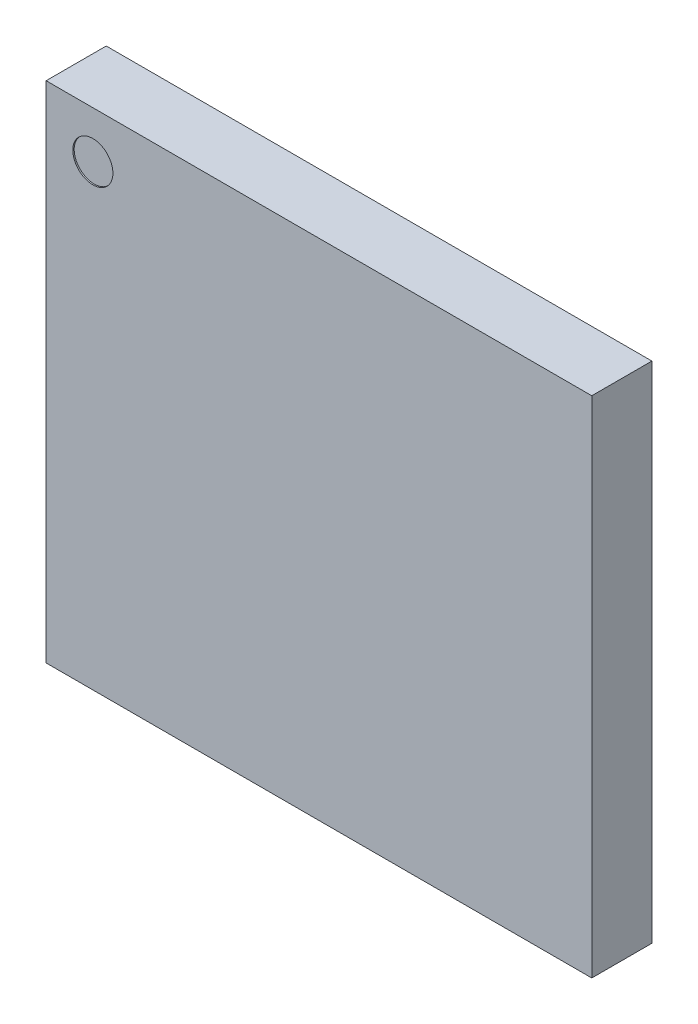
ISO-10303-21;
HEADER;
FILE_DESCRIPTION(('STEP AP214'),'2;1');
FILE_NAME('part.step','',(''),(''),'','','');
FILE_SCHEMA(('AUTOMOTIVE_DESIGN { 1 0 10303 214 1 1 1 1 }'));
ENDSEC;
DATA;
#1=APPLICATION_CONTEXT('core data for automotive mechanical design processes');
#2=APPLICATION_PROTOCOL_DEFINITION('international standard','automotive_design',2000,#1);
#3=PRODUCT_CONTEXT('',#1,'mechanical');
#4=PRODUCT('Part','Part','',(#3));
#5=PRODUCT_RELATED_PRODUCT_CATEGORY('part','',(#4));
#6=PRODUCT_DEFINITION_FORMATION('','',#4);
#7=PRODUCT_DEFINITION_CONTEXT('part definition',#1,'design');
#8=PRODUCT_DEFINITION('design','',#6,#7);
#9=PRODUCT_DEFINITION_SHAPE('','',#8);
#10=(LENGTH_UNIT() NAMED_UNIT(*) SI_UNIT(.MILLI.,.METRE.));
#11=(NAMED_UNIT(*) PLANE_ANGLE_UNIT() SI_UNIT($,.RADIAN.));
#12=(NAMED_UNIT(*) SI_UNIT($,.STERADIAN.) SOLID_ANGLE_UNIT());
#13=UNCERTAINTY_MEASURE_WITH_UNIT(LENGTH_MEASURE(1.E-05),#10,'distance_accuracy_value','');
#14=(GEOMETRIC_REPRESENTATION_CONTEXT(3) GLOBAL_UNCERTAINTY_ASSIGNED_CONTEXT((#13)) GLOBAL_UNIT_ASSIGNED_CONTEXT((#10,
#11,#12)) REPRESENTATION_CONTEXT('',''));
#15=CARTESIAN_POINT('',(0.,0.,0.));
#16=DIRECTION('',(0.,0.,1.));
#17=DIRECTION('',(1.,0.,0.));
#18=AXIS2_PLACEMENT_3D('',#15,#16,#17);
#19=CARTESIAN_POINT('',(0.,-1.88750000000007,0.582499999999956));
#20=DIRECTION('',(0.,0.,1.));
#21=DIRECTION('',(1.,0.,0.));
#22=AXIS2_PLACEMENT_3D('',#19,#20,#21);
#23=PLANE('',#22);
#24=CARTESIAN_POINT('',(-1.69250000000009,1.53749999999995,0.582499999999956));
#25=DIRECTION('',(0.,0.,1.));
#26=DIRECTION('',(1.,0.,0.));
#27=AXIS2_PLACEMENT_3D('',#24,#25,#26);
#28=CIRCLE('',#27,0.15000000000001);
#29=CARTESIAN_POINT('',(-1.54250000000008,1.53749999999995,0.582499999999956));
#30=VERTEX_POINT('',#29);
#31=EDGE_CURVE('E19',#30,#30,#28,.T.);
#32=ORIENTED_EDGE('',*,*,#31,.T.);
#33=EDGE_LOOP('',(#32));
#34=FACE_BOUND('',#33,.T.);
#35=ADVANCED_FACE('F16',(#34),#23,.T.);
#36=CARTESIAN_POINT('',(-1.69250000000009,1.53749999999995,0.592499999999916));
#37=DIRECTION('',(0.,0.,1.));
#38=DIRECTION('',(1.,0.,0.));
#39=AXIS2_PLACEMENT_3D('',#36,#37,#38);
#40=CYLINDRICAL_SURFACE('',#39,0.15000000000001);
#41=ORIENTED_EDGE('',*,*,#31,.F.);
#42=EDGE_LOOP('',(#41));
#43=FACE_BOUND('',#42,.T.);
#44=CARTESIAN_POINT('',(-1.69250000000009,1.53749999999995,0.592499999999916));
#45=DIRECTION('',(0.,0.,1.));
#46=DIRECTION('',(1.,0.,0.));
#47=AXIS2_PLACEMENT_3D('',#44,#45,#46);
#48=CIRCLE('',#47,0.15000000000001);
#49=CARTESIAN_POINT('',(-1.54250000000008,1.53749999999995,0.592499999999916));
#50=VERTEX_POINT('',#49);
#51=EDGE_CURVE('E68',#50,#50,#48,.F.);
#52=ORIENTED_EDGE('',*,*,#51,.F.);
#53=EDGE_LOOP('',(#52));
#54=FACE_BOUND('',#53,.T.);
#55=ADVANCED_FACE('F88',(#43,#54),#40,.F.);
#56=CARTESIAN_POINT('',(-2.04249999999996,-1.88750000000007,0.592499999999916));
#57=DIRECTION('',(0.,0.,1.));
#58=DIRECTION('',(1.,0.,0.));
#59=AXIS2_PLACEMENT_3D('',#56,#57,#58);
#60=PLANE('',#59);
#61=ORIENTED_EDGE('',*,*,#51,.T.);
#62=EDGE_LOOP('',(#61));
#63=FACE_BOUND('',#62,.T.);
#64=DIRECTION('',(0.,1.,0.));
#65=VECTOR('',#64,1.);
#66=CARTESIAN_POINT('',(-2.04249999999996,-1.88750000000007,0.592499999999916));
#67=LINE('',#66,#65);
#68=CARTESIAN_POINT('',(-2.04249999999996,-1.88750000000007,0.592499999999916));
#69=VERTEX_POINT('',#68);
#70=CARTESIAN_POINT('',(-2.04249999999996,1.88750000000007,0.592499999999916));
#71=VERTEX_POINT('',#70);
#72=EDGE_CURVE('E59',#69,#71,#67,.T.);
#73=ORIENTED_EDGE('',*,*,#72,.F.);
#74=DIRECTION('',(1.,0.,0.));
#75=VECTOR('',#74,1.);
#76=CARTESIAN_POINT('',(0.,-1.88750000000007,0.592499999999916));
#77=LINE('',#76,#75);
#78=CARTESIAN_POINT('',(2.04249999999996,-1.88750000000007,0.592499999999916));
#79=VERTEX_POINT('',#78);
#80=EDGE_CURVE('E197',#69,#79,#77,.T.);
#81=ORIENTED_EDGE('',*,*,#80,.T.);
#82=DIRECTION('',(0.,1.,0.));
#83=VECTOR('',#82,1.);
#84=CARTESIAN_POINT('',(2.04249999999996,-1.88750000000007,0.592499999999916));
#85=LINE('',#84,#83);
#86=CARTESIAN_POINT('',(2.04249999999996,1.88750000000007,0.592499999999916));
#87=VERTEX_POINT('',#86);
#88=EDGE_CURVE('E71',#87,#79,#85,.F.);
#89=ORIENTED_EDGE('',*,*,#88,.F.);
#90=DIRECTION('',(1.,0.,0.));
#91=VECTOR('',#90,1.);
#92=CARTESIAN_POINT('',(0.,1.88750000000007,0.592499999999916));
#93=LINE('',#92,#91);
#94=EDGE_CURVE('E54',#71,#87,#93,.T.);
#95=ORIENTED_EDGE('',*,*,#94,.F.);
#96=EDGE_LOOP('',(#73,#81,#89,#95));
#97=FACE_BOUND('',#96,.T.);
#98=ADVANCED_FACE('F70',(#63,#97),#60,.T.);
#99=CARTESIAN_POINT('',(-2.04249999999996,-1.88750000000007,0.142499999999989));
#100=DIRECTION('',(-1.,0.,0.));
#101=DIRECTION('',(0.,0.,1.));
#102=AXIS2_PLACEMENT_3D('',#99,#100,#101);
#103=PLANE('',#102);
#104=DIRECTION('',(0.,1.,0.));
#105=VECTOR('',#104,1.);
#106=CARTESIAN_POINT('',(-2.04249999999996,-1.88750000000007,0.142499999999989));
#107=LINE('',#106,#105);
#108=CARTESIAN_POINT('',(-2.04249999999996,-1.88750000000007,0.142499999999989));
#109=VERTEX_POINT('',#108);
#110=CARTESIAN_POINT('',(-2.04249999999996,1.88750000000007,0.142499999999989));
#111=VERTEX_POINT('',#110);
#112=EDGE_CURVE('E198',#109,#111,#107,.T.);
#113=ORIENTED_EDGE('',*,*,#112,.F.);
#114=DIRECTION('',(0.,0.,1.));
#115=VECTOR('',#114,1.);
#116=CARTESIAN_POINT('',(-2.04249999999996,-1.88750000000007,0.));
#117=LINE('',#116,#115);
#118=EDGE_CURVE('E64',#109,#69,#117,.T.);
#119=ORIENTED_EDGE('',*,*,#118,.T.);
#120=ORIENTED_EDGE('',*,*,#72,.T.);
#121=DIRECTION('',(0.,0.,1.));
#122=VECTOR('',#121,1.);
#123=CARTESIAN_POINT('',(-2.04249999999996,1.88750000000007,0.));
#124=LINE('',#123,#122);
#125=EDGE_CURVE('E61',#111,#71,#124,.T.);
#126=ORIENTED_EDGE('',*,*,#125,.F.);
#127=EDGE_LOOP('',(#113,#119,#120,#126));
#128=FACE_BOUND('',#127,.T.);
#129=ADVANCED_FACE('F60',(#128),#103,.T.);
#130=CARTESIAN_POINT('',(0.,1.88750000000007,0.));
#131=DIRECTION('',(0.,1.,0.));
#132=DIRECTION('',(0.,0.,1.));
#133=AXIS2_PLACEMENT_3D('',#130,#131,#132);
#134=PLANE('',#133);
#135=ORIENTED_EDGE('',*,*,#94,.T.);
#136=DIRECTION('',(0.,0.,-1.));
#137=VECTOR('',#136,1.);
#138=CARTESIAN_POINT('',(2.04249999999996,1.88750000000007,0.592499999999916));
#139=LINE('',#138,#137);
#140=CARTESIAN_POINT('',(2.04249999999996,1.88750000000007,0.142499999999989));
#141=VERTEX_POINT('',#140);
#142=EDGE_CURVE('E73',#141,#87,#139,.F.);
#143=ORIENTED_EDGE('',*,*,#142,.F.);
#144=DIRECTION('',(-1.,0.,0.));
#145=VECTOR('',#144,1.);
#146=CARTESIAN_POINT('',(2.04249999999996,1.88750000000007,0.142499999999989));
#147=LINE('',#146,#145);
#148=EDGE_CURVE('E77',#111,#141,#147,.F.);
#149=ORIENTED_EDGE('',*,*,#148,.F.);
#150=ORIENTED_EDGE('',*,*,#125,.T.);
#151=EDGE_LOOP('',(#135,#143,#149,#150));
#152=FACE_BOUND('',#151,.T.);
#153=ADVANCED_FACE('F75',(#152),#134,.T.);
#154=CARTESIAN_POINT('',(2.04249999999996,-1.88750000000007,0.592499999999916));
#155=DIRECTION('',(1.,0.,0.));
#156=DIRECTION('',(0.,0.,-1.));
#157=AXIS2_PLACEMENT_3D('',#154,#155,#156);
#158=PLANE('',#157);
#159=ORIENTED_EDGE('',*,*,#88,.T.);
#160=DIRECTION('',(0.,0.,1.));
#161=VECTOR('',#160,1.);
#162=CARTESIAN_POINT('',(2.04249999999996,-1.88750000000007,0.));
#163=LINE('',#162,#161);
#164=CARTESIAN_POINT('',(2.04249999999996,-1.88750000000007,0.142499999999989));
#165=VERTEX_POINT('',#164);
#166=EDGE_CURVE('E34',#79,#165,#163,.F.);
#167=ORIENTED_EDGE('',*,*,#166,.T.);
#168=DIRECTION('',(0.,1.,0.));
#169=VECTOR('',#168,1.);
#170=CARTESIAN_POINT('',(2.04249999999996,-1.88750000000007,0.142499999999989));
#171=LINE('',#170,#169);
#172=EDGE_CURVE('E25',#141,#165,#171,.F.);
#173=ORIENTED_EDGE('',*,*,#172,.F.);
#174=ORIENTED_EDGE('',*,*,#142,.T.);
#175=EDGE_LOOP('',(#159,#167,#173,#174));
#176=FACE_BOUND('',#175,.T.);
#177=ADVANCED_FACE('F105',(#176),#158,.T.);
#178=CARTESIAN_POINT('',(0.,-1.88750000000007,0.));
#179=DIRECTION('',(0.,1.,0.));
#180=DIRECTION('',(0.,0.,1.));
#181=AXIS2_PLACEMENT_3D('',#178,#179,#180);
#182=PLANE('',#181);
#183=ORIENTED_EDGE('',*,*,#118,.F.);
#184=DIRECTION('',(-1.,0.,0.));
#185=VECTOR('',#184,1.);
#186=CARTESIAN_POINT('',(2.04249999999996,-1.88750000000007,0.142499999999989));
#187=LINE('',#186,#185);
#188=EDGE_CURVE('E11',#165,#109,#187,.T.);
#189=ORIENTED_EDGE('',*,*,#188,.F.);
#190=ORIENTED_EDGE('',*,*,#166,.F.);
#191=ORIENTED_EDGE('',*,*,#80,.F.);
#192=EDGE_LOOP('',(#183,#189,#190,#191));
#193=FACE_BOUND('',#192,.T.);
#194=ADVANCED_FACE('F99',(#193),#182,.F.);
#195=CARTESIAN_POINT('',(2.04249999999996,-1.88750000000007,0.142499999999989));
#196=DIRECTION('',(0.,0.,-1.));
#197=DIRECTION('',(-1.,0.,0.));
#198=AXIS2_PLACEMENT_3D('',#195,#196,#197);
#199=PLANE('',#198);
#200=ORIENTED_EDGE('',*,*,#172,.T.);
#201=ORIENTED_EDGE('',*,*,#188,.T.);
#202=ORIENTED_EDGE('',*,*,#112,.T.);
#203=ORIENTED_EDGE('',*,*,#148,.T.);
#204=EDGE_LOOP('',(#200,#201,#202,#203));
#205=FACE_BOUND('',#204,.T.);
#206=ADVANCED_FACE('F97',(#205),#199,.T.);
#207=CLOSED_SHELL('',(#35,#55,#98,#129,#153,#177,#194,#206));
#208=MANIFOLD_SOLID_BREP('B1',#207);
#209=ADVANCED_BREP_SHAPE_REPRESENTATION('',(#18,#208),#14);
#210=SHAPE_DEFINITION_REPRESENTATION(#9,#209);
ENDSEC;
END-ISO-10303-21;
